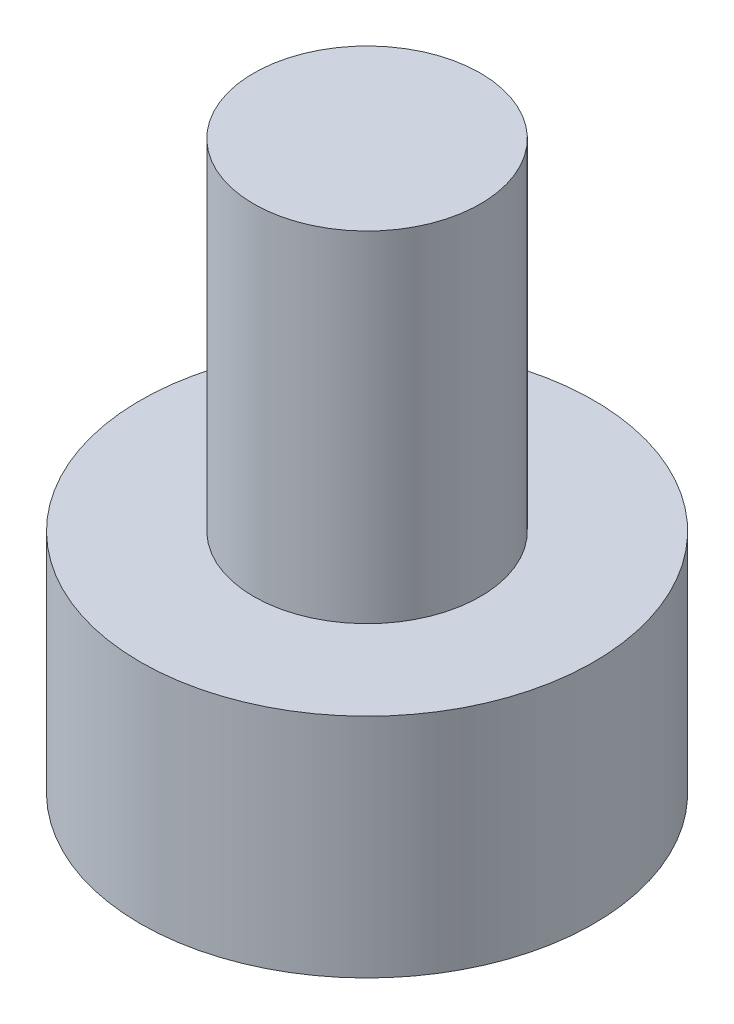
from build123d import *

# Parameters (mm, degrees)
SKETCH1_R           = 8
BOSS_EXTRUDE1_DEPTH = 8
SKETCH2_R           = 4
BOSS_EXTRUDE2_DEPTH = 12


with BuildPart() as part:
    # Sketch1 → Boss-Extrude1 (new body)
    with BuildSketch(Plane(origin=(0, 0, 0), x_dir=(1, 0, 0), z_dir=(0, 1, 0))):
        with Locations(Location((0, 0, 0), (0, 0, 270))):
            Circle(SKETCH1_R)
    extrude(amount=BOSS_EXTRUDE1_DEPTH)

    # Sketch2 → Boss-Extrude2 (add)
    with BuildSketch(Plane(origin=(0, 8, 0), x_dir=(1, 0, 0), z_dir=(0, 1, 0))):
        with Locations(Location((0, 0, 0), (0, 0, 270))):
            Circle(SKETCH2_R)
    extrude(amount=BOSS_EXTRUDE2_DEPTH)


solid = part.part
